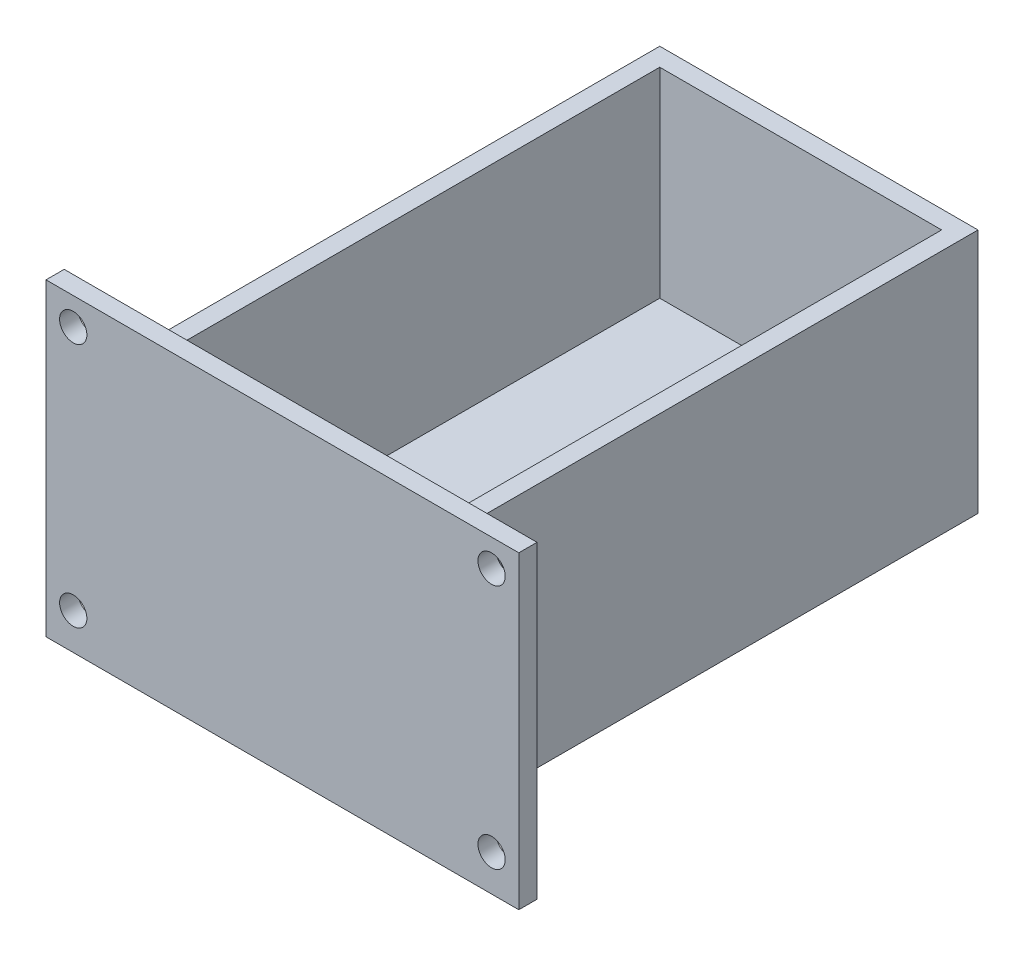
ISO-10303-21;
HEADER;
FILE_DESCRIPTION(('STEP AP214'),'2;1');
FILE_NAME('part.step','',(''),(''),'','','');
FILE_SCHEMA(('AUTOMOTIVE_DESIGN { 1 0 10303 214 1 1 1 1 }'));
ENDSEC;
DATA;
#1=APPLICATION_CONTEXT('core data for automotive mechanical design processes');
#2=APPLICATION_PROTOCOL_DEFINITION('international standard','automotive_design',2000,#1);
#3=PRODUCT_CONTEXT('',#1,'mechanical');
#4=PRODUCT('Part','Part','',(#3));
#5=PRODUCT_RELATED_PRODUCT_CATEGORY('part','',(#4));
#6=PRODUCT_DEFINITION_FORMATION('','',#4);
#7=PRODUCT_DEFINITION_CONTEXT('part definition',#1,'design');
#8=PRODUCT_DEFINITION('design','',#6,#7);
#9=PRODUCT_DEFINITION_SHAPE('','',#8);
#10=(LENGTH_UNIT() NAMED_UNIT(*) SI_UNIT(.MILLI.,.METRE.));
#11=(NAMED_UNIT(*) PLANE_ANGLE_UNIT() SI_UNIT($,.RADIAN.));
#12=(NAMED_UNIT(*) SI_UNIT($,.STERADIAN.) SOLID_ANGLE_UNIT());
#13=UNCERTAINTY_MEASURE_WITH_UNIT(LENGTH_MEASURE(1.E-05),#10,'distance_accuracy_value','');
#14=(GEOMETRIC_REPRESENTATION_CONTEXT(3) GLOBAL_UNCERTAINTY_ASSIGNED_CONTEXT((#13)) GLOBAL_UNIT_ASSIGNED_CONTEXT((#10,
#11,#12)) REPRESENTATION_CONTEXT('',''));
#15=CARTESIAN_POINT('',(0.,0.,0.));
#16=DIRECTION('',(0.,0.,1.));
#17=DIRECTION('',(1.,0.,0.));
#18=AXIS2_PLACEMENT_3D('',#15,#16,#17);
#19=CARTESIAN_POINT('',(17.5,15.,-57.));
#20=DIRECTION('',(1.,0.,0.));
#21=DIRECTION('',(0.,1.,0.));
#22=AXIS2_PLACEMENT_3D('',#19,#20,#21);
#23=PLANE('',#22);
#24=DIRECTION('',(0.,1.,0.));
#25=VECTOR('',#24,1.);
#26=CARTESIAN_POINT('',(17.5,15.,0.));
#27=LINE('',#26,#25);
#28=CARTESIAN_POINT('',(17.5,-12.,0.));
#29=VERTEX_POINT('',#28);
#30=CARTESIAN_POINT('',(17.5,15.,0.));
#31=VERTEX_POINT('',#30);
#32=EDGE_CURVE('E162',#29,#31,#27,.T.);
#33=ORIENTED_EDGE('',*,*,#32,.F.);
#34=DIRECTION('',(0.,0.,1.));
#35=VECTOR('',#34,1.);
#36=CARTESIAN_POINT('',(17.5,-12.,-57.));
#37=LINE('',#36,#35);
#38=CARTESIAN_POINT('',(17.5,-12.,-57.));
#39=VERTEX_POINT('',#38);
#40=EDGE_CURVE('E193',#39,#29,#37,.T.);
#41=ORIENTED_EDGE('',*,*,#40,.F.);
#42=DIRECTION('',(0.,1.,0.));
#43=VECTOR('',#42,1.);
#44=CARTESIAN_POINT('',(17.5,15.,-57.));
#45=LINE('',#44,#43);
#46=CARTESIAN_POINT('',(17.5,15.,-57.));
#47=VERTEX_POINT('',#46);
#48=EDGE_CURVE('E163',#39,#47,#45,.T.);
#49=ORIENTED_EDGE('',*,*,#48,.T.);
#50=DIRECTION('',(0.,0.,1.));
#51=VECTOR('',#50,1.);
#52=CARTESIAN_POINT('',(17.5,15.,-57.));
#53=LINE('',#52,#51);
#54=EDGE_CURVE('E40',#47,#31,#53,.T.);
#55=ORIENTED_EDGE('',*,*,#54,.T.);
#56=EDGE_LOOP('',(#33,#41,#49,#55));
#57=FACE_BOUND('',#56,.T.);
#58=ADVANCED_FACE('F37',(#57),#23,.T.);
#59=CARTESIAN_POINT('',(-17.5,15.,-57.));
#60=DIRECTION('',(-1.,0.,0.));
#61=DIRECTION('',(0.,-1.,0.));
#62=AXIS2_PLACEMENT_3D('',#59,#60,#61);
#63=PLANE('',#62);
#64=DIRECTION('',(0.,-1.,0.));
#65=VECTOR('',#64,1.);
#66=CARTESIAN_POINT('',(-17.5,15.,-57.));
#67=LINE('',#66,#65);
#68=CARTESIAN_POINT('',(-17.5,15.,-57.));
#69=VERTEX_POINT('',#68);
#70=CARTESIAN_POINT('',(-17.5,-12.,-57.));
#71=VERTEX_POINT('',#70);
#72=EDGE_CURVE('E169',#69,#71,#67,.T.);
#73=ORIENTED_EDGE('',*,*,#72,.T.);
#74=DIRECTION('',(0.,0.,-1.));
#75=VECTOR('',#74,1.);
#76=CARTESIAN_POINT('',(-17.5,-12.,0.));
#77=LINE('',#76,#75);
#78=CARTESIAN_POINT('',(-17.5,-12.,0.));
#79=VERTEX_POINT('',#78);
#80=EDGE_CURVE('E188',#79,#71,#77,.T.);
#81=ORIENTED_EDGE('',*,*,#80,.F.);
#82=DIRECTION('',(0.,-1.,0.));
#83=VECTOR('',#82,1.);
#84=CARTESIAN_POINT('',(-17.5,15.,0.));
#85=LINE('',#84,#83);
#86=CARTESIAN_POINT('',(-17.5,15.,0.));
#87=VERTEX_POINT('',#86);
#88=EDGE_CURVE('E166',#87,#79,#85,.T.);
#89=ORIENTED_EDGE('',*,*,#88,.F.);
#90=DIRECTION('',(0.,0.,1.));
#91=VECTOR('',#90,1.);
#92=CARTESIAN_POINT('',(-17.5,15.,-57.));
#93=LINE('',#92,#91);
#94=EDGE_CURVE('E11',#69,#87,#93,.T.);
#95=ORIENTED_EDGE('',*,*,#94,.F.);
#96=EDGE_LOOP('',(#73,#81,#89,#95));
#97=FACE_BOUND('',#96,.T.);
#98=ADVANCED_FACE('F186',(#97),#63,.T.);
#99=CARTESIAN_POINT('',(0.,0.,-57.));
#100=DIRECTION('',(0.,0.,1.));
#101=DIRECTION('',(1.,0.,0.));
#102=AXIS2_PLACEMENT_3D('',#99,#100,#101);
#103=PLANE('',#102);
#104=DIRECTION('',(1.,0.,0.));
#105=VECTOR('',#104,1.);
#106=CARTESIAN_POINT('',(-17.5,-12.,-57.));
#107=LINE('',#106,#105);
#108=EDGE_CURVE('E191',#71,#39,#107,.T.);
#109=ORIENTED_EDGE('',*,*,#108,.F.);
#110=ORIENTED_EDGE('',*,*,#72,.F.);
#111=DIRECTION('',(-1.,0.,0.));
#112=VECTOR('',#111,1.);
#113=CARTESIAN_POINT('',(-17.5,15.,-57.));
#114=LINE('',#113,#112);
#115=EDGE_CURVE('E165',#47,#69,#114,.T.);
#116=ORIENTED_EDGE('',*,*,#115,.F.);
#117=ORIENTED_EDGE('',*,*,#48,.F.);
#118=EDGE_LOOP('',(#109,#110,#116,#117));
#119=FACE_BOUND('',#118,.T.);
#120=ADVANCED_FACE('F284',(#119),#103,.F.);
#121=CARTESIAN_POINT('',(-17.5,15.,-57.));
#122=DIRECTION('',(0.,1.,0.));
#123=DIRECTION('',(0.,0.,1.));
#124=AXIS2_PLACEMENT_3D('',#121,#122,#123);
#125=PLANE('',#124);
#126=DIRECTION('',(-1.,0.,0.));
#127=VECTOR('',#126,1.);
#128=CARTESIAN_POINT('',(-17.5,15.,0.));
#129=LINE('',#128,#127);
#130=EDGE_CURVE('E173',#31,#87,#129,.T.);
#131=ORIENTED_EDGE('',*,*,#130,.F.);
#132=ORIENTED_EDGE('',*,*,#54,.F.);
#133=ORIENTED_EDGE('',*,*,#115,.T.);
#134=ORIENTED_EDGE('',*,*,#94,.T.);
#135=EDGE_LOOP('',(#131,#132,#133,#134));
#136=FACE_BOUND('',#135,.T.);
#137=DIRECTION('',(0.,0.,1.));
#138=VECTOR('',#137,1.);
#139=CARTESIAN_POINT('',(-15.5,15.,-55.));
#140=LINE('',#139,#138);
#141=CARTESIAN_POINT('',(-15.5,15.,-55.));
#142=VERTEX_POINT('',#141);
#143=CARTESIAN_POINT('',(-15.5,15.,-2.));
#144=VERTEX_POINT('',#143);
#145=EDGE_CURVE('E203',#142,#144,#140,.T.);
#146=ORIENTED_EDGE('',*,*,#145,.F.);
#147=DIRECTION('',(1.,0.,0.));
#148=VECTOR('',#147,1.);
#149=CARTESIAN_POINT('',(-15.5,15.,-55.));
#150=LINE('',#149,#148);
#151=CARTESIAN_POINT('',(15.5,15.,-55.));
#152=VERTEX_POINT('',#151);
#153=EDGE_CURVE('E59',#142,#152,#150,.T.);
#154=ORIENTED_EDGE('',*,*,#153,.T.);
#155=DIRECTION('',(0.,0.,1.));
#156=VECTOR('',#155,1.);
#157=CARTESIAN_POINT('',(15.5,15.,-55.));
#158=LINE('',#157,#156);
#159=CARTESIAN_POINT('',(15.5,15.,-2.));
#160=VERTEX_POINT('',#159);
#161=EDGE_CURVE('E213',#152,#160,#158,.T.);
#162=ORIENTED_EDGE('',*,*,#161,.T.);
#163=DIRECTION('',(1.,0.,0.));
#164=VECTOR('',#163,1.);
#165=CARTESIAN_POINT('',(-15.5,15.,-2.));
#166=LINE('',#165,#164);
#167=EDGE_CURVE('E216',#144,#160,#166,.T.);
#168=ORIENTED_EDGE('',*,*,#167,.F.);
#169=EDGE_LOOP('',(#146,#154,#162,#168));
#170=FACE_BOUND('',#169,.T.);
#171=ADVANCED_FACE('F276',(#136,#170),#125,.T.);
#172=CARTESIAN_POINT('',(0.,0.,0.));
#173=DIRECTION('',(0.,0.,1.));
#174=DIRECTION('',(1.,0.,0.));
#175=AXIS2_PLACEMENT_3D('',#172,#173,#174);
#176=PLANE('',#175);
#177=CARTESIAN_POINT('',(23.0044087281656,-12.,0.));
#178=DIRECTION('',(0.,0.,1.));
#179=DIRECTION('',(1.,0.,0.));
#180=AXIS2_PLACEMENT_3D('',#177,#178,#179);
#181=CIRCLE('',#180,1.5);
#182=CARTESIAN_POINT('',(24.5044087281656,-12.,0.));
#183=VERTEX_POINT('',#182);
#184=EDGE_CURVE('E130',#183,#183,#181,.T.);
#185=ORIENTED_EDGE('',*,*,#184,.T.);
#186=EDGE_LOOP('',(#185));
#187=FACE_BOUND('',#186,.T.);
#188=CARTESIAN_POINT('',(-23.0044087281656,-12.,0.));
#189=DIRECTION('',(0.,0.,1.));
#190=DIRECTION('',(1.,0.,0.));
#191=AXIS2_PLACEMENT_3D('',#188,#189,#190);
#192=CIRCLE('',#191,1.5);
#193=CARTESIAN_POINT('',(-21.5044087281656,-12.,0.));
#194=VERTEX_POINT('',#193);
#195=EDGE_CURVE('E237',#194,#194,#192,.T.);
#196=ORIENTED_EDGE('',*,*,#195,.T.);
#197=EDGE_LOOP('',(#196));
#198=FACE_BOUND('',#197,.T.);
#199=CARTESIAN_POINT('',(-23.0044087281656,15.,0.));
#200=DIRECTION('',(0.,0.,1.));
#201=DIRECTION('',(1.,0.,0.));
#202=AXIS2_PLACEMENT_3D('',#199,#200,#201);
#203=CIRCLE('',#202,1.5);
#204=CARTESIAN_POINT('',(-21.5044087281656,15.,0.));
#205=VERTEX_POINT('',#204);
#206=EDGE_CURVE('E240',#205,#205,#203,.T.);
#207=ORIENTED_EDGE('',*,*,#206,.T.);
#208=EDGE_LOOP('',(#207));
#209=FACE_BOUND('',#208,.T.);
#210=CARTESIAN_POINT('',(23.0044087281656,15.,0.));
#211=DIRECTION('',(0.,0.,1.));
#212=DIRECTION('',(1.,0.,0.));
#213=AXIS2_PLACEMENT_3D('',#210,#211,#212);
#214=CIRCLE('',#213,1.5);
#215=CARTESIAN_POINT('',(24.5044087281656,15.,0.));
#216=VERTEX_POINT('',#215);
#217=EDGE_CURVE('E243',#216,#216,#214,.T.);
#218=ORIENTED_EDGE('',*,*,#217,.T.);
#219=EDGE_LOOP('',(#218));
#220=FACE_BOUND('',#219,.T.);
#221=DIRECTION('',(-1.,0.,0.));
#222=VECTOR('',#221,1.);
#223=CARTESIAN_POINT('',(17.5,-12.,0.));
#224=LINE('',#223,#222);
#225=EDGE_CURVE('E181',#29,#79,#224,.T.);
#226=ORIENTED_EDGE('',*,*,#225,.F.);
#227=ORIENTED_EDGE('',*,*,#32,.T.);
#228=ORIENTED_EDGE('',*,*,#130,.T.);
#229=ORIENTED_EDGE('',*,*,#88,.T.);
#230=EDGE_LOOP('',(#226,#227,#228,#229));
#231=FACE_BOUND('',#230,.T.);
#232=DIRECTION('',(0.,1.,0.));
#233=VECTOR('',#232,1.);
#234=CARTESIAN_POINT('',(26.,18.,0.));
#235=LINE('',#234,#233);
#236=CARTESIAN_POINT('',(26.,-16.,0.));
#237=VERTEX_POINT('',#236);
#238=CARTESIAN_POINT('',(26.,18.,0.));
#239=VERTEX_POINT('',#238);
#240=EDGE_CURVE('E154',#237,#239,#235,.T.);
#241=ORIENTED_EDGE('',*,*,#240,.F.);
#242=DIRECTION('',(-1.,0.,0.));
#243=VECTOR('',#242,1.);
#244=CARTESIAN_POINT('',(0.,-16.,0.));
#245=LINE('',#244,#243);
#246=CARTESIAN_POINT('',(-26.,-16.,0.));
#247=VERTEX_POINT('',#246);
#248=EDGE_CURVE('E140',#237,#247,#245,.T.);
#249=ORIENTED_EDGE('',*,*,#248,.T.);
#250=DIRECTION('',(0.,-1.,0.));
#251=VECTOR('',#250,1.);
#252=CARTESIAN_POINT('',(-26.,18.,0.));
#253=LINE('',#252,#251);
#254=CARTESIAN_POINT('',(-26.,18.,0.));
#255=VERTEX_POINT('',#254);
#256=EDGE_CURVE('E139',#255,#247,#253,.T.);
#257=ORIENTED_EDGE('',*,*,#256,.F.);
#258=DIRECTION('',(-1.,0.,0.));
#259=VECTOR('',#258,1.);
#260=CARTESIAN_POINT('',(-26.,18.,0.));
#261=LINE('',#260,#259);
#262=EDGE_CURVE('E156',#239,#255,#261,.T.);
#263=ORIENTED_EDGE('',*,*,#262,.F.);
#264=EDGE_LOOP('',(#241,#249,#257,#263));
#265=FACE_BOUND('',#264,.T.);
#266=ADVANCED_FACE('F179',(#187,#198,#209,#220,#231,#265),#176,.F.);
#267=CARTESIAN_POINT('',(26.,18.,2.));
#268=DIRECTION('',(-1.,0.,0.));
#269=DIRECTION('',(0.,0.,1.));
#270=AXIS2_PLACEMENT_3D('',#267,#268,#269);
#271=PLANE('',#270);
#272=DIRECTION('',(0.,1.,0.));
#273=VECTOR('',#272,1.);
#274=CARTESIAN_POINT('',(26.,18.,2.));
#275=LINE('',#274,#273);
#276=CARTESIAN_POINT('',(26.,-16.,2.));
#277=VERTEX_POINT('',#276);
#278=CARTESIAN_POINT('',(26.,18.,2.));
#279=VERTEX_POINT('',#278);
#280=EDGE_CURVE('E150',#277,#279,#275,.T.);
#281=ORIENTED_EDGE('',*,*,#280,.F.);
#282=DIRECTION('',(0.,0.,1.));
#283=VECTOR('',#282,1.);
#284=CARTESIAN_POINT('',(26.,-16.,-57.));
#285=LINE('',#284,#283);
#286=EDGE_CURVE('E51',#237,#277,#285,.T.);
#287=ORIENTED_EDGE('',*,*,#286,.F.);
#288=ORIENTED_EDGE('',*,*,#240,.T.);
#289=DIRECTION('',(0.,0.,-1.));
#290=VECTOR('',#289,1.);
#291=CARTESIAN_POINT('',(26.,18.,2.));
#292=LINE('',#291,#290);
#293=EDGE_CURVE('E148',#279,#239,#292,.T.);
#294=ORIENTED_EDGE('',*,*,#293,.F.);
#295=EDGE_LOOP('',(#281,#287,#288,#294));
#296=FACE_BOUND('',#295,.T.);
#297=ADVANCED_FACE('F230',(#296),#271,.F.);
#298=CARTESIAN_POINT('',(-26.,18.,2.));
#299=DIRECTION('',(0.,-1.,0.));
#300=DIRECTION('',(0.,0.,-1.));
#301=AXIS2_PLACEMENT_3D('',#298,#299,#300);
#302=PLANE('',#301);
#303=ORIENTED_EDGE('',*,*,#262,.T.);
#304=DIRECTION('',(0.,0.,-1.));
#305=VECTOR('',#304,1.);
#306=CARTESIAN_POINT('',(-26.,18.,2.));
#307=LINE('',#306,#305);
#308=CARTESIAN_POINT('',(-26.,18.,2.));
#309=VERTEX_POINT('',#308);
#310=EDGE_CURVE('E146',#309,#255,#307,.T.);
#311=ORIENTED_EDGE('',*,*,#310,.F.);
#312=DIRECTION('',(-1.,0.,0.));
#313=VECTOR('',#312,1.);
#314=CARTESIAN_POINT('',(-26.,18.,2.));
#315=LINE('',#314,#313);
#316=EDGE_CURVE('E144',#279,#309,#315,.T.);
#317=ORIENTED_EDGE('',*,*,#316,.F.);
#318=ORIENTED_EDGE('',*,*,#293,.T.);
#319=EDGE_LOOP('',(#303,#311,#317,#318));
#320=FACE_BOUND('',#319,.T.);
#321=ADVANCED_FACE('F229',(#320),#302,.F.);
#322=CARTESIAN_POINT('',(-26.,18.,2.));
#323=DIRECTION('',(1.,0.,0.));
#324=DIRECTION('',(0.,0.,-1.));
#325=AXIS2_PLACEMENT_3D('',#322,#323,#324);
#326=PLANE('',#325);
#327=ORIENTED_EDGE('',*,*,#256,.T.);
#328=DIRECTION('',(0.,0.,1.));
#329=VECTOR('',#328,1.);
#330=CARTESIAN_POINT('',(-26.,-16.,-57.));
#331=LINE('',#330,#329);
#332=CARTESIAN_POINT('',(-26.,-16.,2.));
#333=VERTEX_POINT('',#332);
#334=EDGE_CURVE('E125',#247,#333,#331,.T.);
#335=ORIENTED_EDGE('',*,*,#334,.T.);
#336=DIRECTION('',(0.,-1.,0.));
#337=VECTOR('',#336,1.);
#338=CARTESIAN_POINT('',(-26.,18.,2.));
#339=LINE('',#338,#337);
#340=EDGE_CURVE('E137',#309,#333,#339,.T.);
#341=ORIENTED_EDGE('',*,*,#340,.F.);
#342=ORIENTED_EDGE('',*,*,#310,.T.);
#343=EDGE_LOOP('',(#327,#335,#341,#342));
#344=FACE_BOUND('',#343,.T.);
#345=ADVANCED_FACE('F135',(#344),#326,.F.);
#346=CARTESIAN_POINT('',(0.,0.,2.));
#347=DIRECTION('',(0.,0.,1.));
#348=DIRECTION('',(1.,0.,0.));
#349=AXIS2_PLACEMENT_3D('',#346,#347,#348);
#350=PLANE('',#349);
#351=CARTESIAN_POINT('',(23.0044087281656,-12.,2.));
#352=DIRECTION('',(0.,0.,1.));
#353=DIRECTION('',(1.,0.,0.));
#354=AXIS2_PLACEMENT_3D('',#351,#352,#353);
#355=CIRCLE('',#354,1.5);
#356=CARTESIAN_POINT('',(24.5044087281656,-12.,2.));
#357=VERTEX_POINT('',#356);
#358=EDGE_CURVE('E250',#357,#357,#355,.T.);
#359=ORIENTED_EDGE('',*,*,#358,.F.);
#360=EDGE_LOOP('',(#359));
#361=FACE_BOUND('',#360,.T.);
#362=CARTESIAN_POINT('',(-23.0044087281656,-12.,2.));
#363=DIRECTION('',(0.,0.,1.));
#364=DIRECTION('',(-1.,0.,0.));
#365=AXIS2_PLACEMENT_3D('',#362,#363,#364);
#366=CIRCLE('',#365,1.5);
#367=CARTESIAN_POINT('',(-24.5044087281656,-12.,2.));
#368=VERTEX_POINT('',#367);
#369=EDGE_CURVE('E253',#368,#368,#366,.T.);
#370=ORIENTED_EDGE('',*,*,#369,.F.);
#371=EDGE_LOOP('',(#370));
#372=FACE_BOUND('',#371,.T.);
#373=CARTESIAN_POINT('',(-23.0044087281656,15.,2.));
#374=DIRECTION('',(0.,0.,1.));
#375=DIRECTION('',(1.,0.,0.));
#376=AXIS2_PLACEMENT_3D('',#373,#374,#375);
#377=CIRCLE('',#376,1.5);
#378=CARTESIAN_POINT('',(-21.5044087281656,15.,2.));
#379=VERTEX_POINT('',#378);
#380=EDGE_CURVE('E249',#379,#379,#377,.T.);
#381=ORIENTED_EDGE('',*,*,#380,.F.);
#382=EDGE_LOOP('',(#381));
#383=FACE_BOUND('',#382,.T.);
#384=CARTESIAN_POINT('',(23.0044087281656,15.,2.));
#385=DIRECTION('',(0.,0.,1.));
#386=DIRECTION('',(-1.,0.,0.));
#387=AXIS2_PLACEMENT_3D('',#384,#385,#386);
#388=CIRCLE('',#387,1.5);
#389=CARTESIAN_POINT('',(21.5044087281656,15.,2.));
#390=VERTEX_POINT('',#389);
#391=EDGE_CURVE('E246',#390,#390,#388,.T.);
#392=ORIENTED_EDGE('',*,*,#391,.F.);
#393=EDGE_LOOP('',(#392));
#394=FACE_BOUND('',#393,.T.);
#395=DIRECTION('',(-1.,0.,0.));
#396=VECTOR('',#395,1.);
#397=CARTESIAN_POINT('',(-26.,-16.,2.));
#398=LINE('',#397,#396);
#399=EDGE_CURVE('E122',#277,#333,#398,.T.);
#400=ORIENTED_EDGE('',*,*,#399,.F.);
#401=ORIENTED_EDGE('',*,*,#280,.T.);
#402=ORIENTED_EDGE('',*,*,#316,.T.);
#403=ORIENTED_EDGE('',*,*,#340,.T.);
#404=EDGE_LOOP('',(#400,#401,#402,#403));
#405=FACE_BOUND('',#404,.T.);
#406=ADVANCED_FACE('F142',(#361,#372,#383,#394,#405),#350,.T.);
#407=CARTESIAN_POINT('',(-15.5,-7.,-55.));
#408=DIRECTION('',(0.,0.,1.));
#409=DIRECTION('',(1.,0.,0.));
#410=AXIS2_PLACEMENT_3D('',#407,#408,#409);
#411=PLANE('',#410);
#412=ORIENTED_EDGE('',*,*,#153,.F.);
#413=DIRECTION('',(0.,1.,0.));
#414=VECTOR('',#413,1.);
#415=CARTESIAN_POINT('',(-15.5,-7.,-55.));
#416=LINE('',#415,#414);
#417=CARTESIAN_POINT('',(-15.5,-7.,-55.));
#418=VERTEX_POINT('',#417);
#419=EDGE_CURVE('E211',#418,#142,#416,.T.);
#420=ORIENTED_EDGE('',*,*,#419,.F.);
#421=DIRECTION('',(1.,0.,0.));
#422=VECTOR('',#421,1.);
#423=CARTESIAN_POINT('',(-15.5,-7.,-55.));
#424=LINE('',#423,#422);
#425=CARTESIAN_POINT('',(15.5,-7.,-55.));
#426=VERTEX_POINT('',#425);
#427=EDGE_CURVE('E199',#418,#426,#424,.T.);
#428=ORIENTED_EDGE('',*,*,#427,.T.);
#429=DIRECTION('',(0.,1.,0.));
#430=VECTOR('',#429,1.);
#431=CARTESIAN_POINT('',(15.5,-7.,-55.));
#432=LINE('',#431,#430);
#433=EDGE_CURVE('E157',#426,#152,#432,.T.);
#434=ORIENTED_EDGE('',*,*,#433,.T.);
#435=EDGE_LOOP('',(#412,#420,#428,#434));
#436=FACE_BOUND('',#435,.T.);
#437=ADVANCED_FACE('F264',(#436),#411,.T.);
#438=CARTESIAN_POINT('',(15.5,-7.,-55.));
#439=DIRECTION('',(-1.,0.,0.));
#440=DIRECTION('',(0.,0.,1.));
#441=AXIS2_PLACEMENT_3D('',#438,#439,#440);
#442=PLANE('',#441);
#443=ORIENTED_EDGE('',*,*,#161,.F.);
#444=ORIENTED_EDGE('',*,*,#433,.F.);
#445=DIRECTION('',(0.,0.,1.));
#446=VECTOR('',#445,1.);
#447=CARTESIAN_POINT('',(15.5,-7.,-55.));
#448=LINE('',#447,#446);
#449=CARTESIAN_POINT('',(15.5,-7.,-2.));
#450=VERTEX_POINT('',#449);
#451=EDGE_CURVE('E202',#426,#450,#448,.T.);
#452=ORIENTED_EDGE('',*,*,#451,.T.);
#453=DIRECTION('',(0.,1.,0.));
#454=VECTOR('',#453,1.);
#455=CARTESIAN_POINT('',(15.5,-7.,-2.));
#456=LINE('',#455,#454);
#457=EDGE_CURVE('E224',#450,#160,#456,.T.);
#458=ORIENTED_EDGE('',*,*,#457,.T.);
#459=EDGE_LOOP('',(#443,#444,#452,#458));
#460=FACE_BOUND('',#459,.T.);
#461=ADVANCED_FACE('F321',(#460),#442,.T.);
#462=CARTESIAN_POINT('',(-15.5,-7.,-2.));
#463=DIRECTION('',(0.,0.,1.));
#464=DIRECTION('',(1.,0.,0.));
#465=AXIS2_PLACEMENT_3D('',#462,#463,#464);
#466=PLANE('',#465);
#467=ORIENTED_EDGE('',*,*,#167,.T.);
#468=ORIENTED_EDGE('',*,*,#457,.F.);
#469=DIRECTION('',(1.,0.,0.));
#470=VECTOR('',#469,1.);
#471=CARTESIAN_POINT('',(-15.5,-7.,-2.));
#472=LINE('',#471,#470);
#473=CARTESIAN_POINT('',(-15.5,-7.,-2.));
#474=VERTEX_POINT('',#473);
#475=EDGE_CURVE('E205',#474,#450,#472,.T.);
#476=ORIENTED_EDGE('',*,*,#475,.F.);
#477=DIRECTION('',(0.,1.,0.));
#478=VECTOR('',#477,1.);
#479=CARTESIAN_POINT('',(-15.5,-7.,-2.));
#480=LINE('',#479,#478);
#481=EDGE_CURVE('E222',#474,#144,#480,.T.);
#482=ORIENTED_EDGE('',*,*,#481,.T.);
#483=EDGE_LOOP('',(#467,#468,#476,#482));
#484=FACE_BOUND('',#483,.T.);
#485=ADVANCED_FACE('F317',(#484),#466,.F.);
#486=CARTESIAN_POINT('',(-15.5,-7.,-55.));
#487=DIRECTION('',(-1.,0.,0.));
#488=DIRECTION('',(0.,0.,1.));
#489=AXIS2_PLACEMENT_3D('',#486,#487,#488);
#490=PLANE('',#489);
#491=ORIENTED_EDGE('',*,*,#145,.T.);
#492=ORIENTED_EDGE('',*,*,#481,.F.);
#493=DIRECTION('',(0.,0.,1.));
#494=VECTOR('',#493,1.);
#495=CARTESIAN_POINT('',(-15.5,-7.,-55.));
#496=LINE('',#495,#494);
#497=EDGE_CURVE('E208',#418,#474,#496,.T.);
#498=ORIENTED_EDGE('',*,*,#497,.F.);
#499=ORIENTED_EDGE('',*,*,#419,.T.);
#500=EDGE_LOOP('',(#491,#492,#498,#499));
#501=FACE_BOUND('',#500,.T.);
#502=ADVANCED_FACE('F311',(#501),#490,.F.);
#503=CARTESIAN_POINT('',(0.,-7.,0.));
#504=DIRECTION('',(0.,-1.,0.));
#505=DIRECTION('',(0.,0.,-1.));
#506=AXIS2_PLACEMENT_3D('',#503,#504,#505);
#507=PLANE('',#506);
#508=ORIENTED_EDGE('',*,*,#427,.F.);
#509=ORIENTED_EDGE('',*,*,#497,.T.);
#510=ORIENTED_EDGE('',*,*,#475,.T.);
#511=ORIENTED_EDGE('',*,*,#451,.F.);
#512=EDGE_LOOP('',(#508,#509,#510,#511));
#513=FACE_BOUND('',#512,.T.);
#514=ADVANCED_FACE('F304',(#513),#507,.F.);
#515=CARTESIAN_POINT('',(0.,-12.,0.));
#516=DIRECTION('',(0.,-1.,0.));
#517=DIRECTION('',(0.,0.,-1.));
#518=AXIS2_PLACEMENT_3D('',#515,#516,#517);
#519=PLANE('',#518);
#520=ORIENTED_EDGE('',*,*,#225,.T.);
#521=ORIENTED_EDGE('',*,*,#80,.T.);
#522=ORIENTED_EDGE('',*,*,#108,.T.);
#523=ORIENTED_EDGE('',*,*,#40,.T.);
#524=EDGE_LOOP('',(#520,#521,#522,#523));
#525=FACE_BOUND('',#524,.T.);
#526=ADVANCED_FACE('F302',(#525),#519,.T.);
#527=CARTESIAN_POINT('',(-26.,-16.,-57.));
#528=DIRECTION('',(0.,1.,0.));
#529=DIRECTION('',(0.,0.,1.));
#530=AXIS2_PLACEMENT_3D('',#527,#528,#529);
#531=PLANE('',#530);
#532=ORIENTED_EDGE('',*,*,#286,.T.);
#533=ORIENTED_EDGE('',*,*,#399,.T.);
#534=ORIENTED_EDGE('',*,*,#334,.F.);
#535=ORIENTED_EDGE('',*,*,#248,.F.);
#536=EDGE_LOOP('',(#532,#533,#534,#535));
#537=FACE_BOUND('',#536,.T.);
#538=ADVANCED_FACE('F124',(#537),#531,.F.);
#539=CARTESIAN_POINT('',(23.0044087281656,15.,-25.));
#540=DIRECTION('',(0.,0.,1.));
#541=DIRECTION('',(1.,0.,0.));
#542=AXIS2_PLACEMENT_3D('',#539,#540,#541);
#543=CYLINDRICAL_SURFACE('',#542,1.5);
#544=ORIENTED_EDGE('',*,*,#391,.T.);
#545=EDGE_LOOP('',(#544));
#546=FACE_BOUND('',#545,.T.);
#547=ORIENTED_EDGE('',*,*,#217,.F.);
#548=EDGE_LOOP('',(#547));
#549=FACE_BOUND('',#548,.T.);
#550=ADVANCED_FACE('F269',(#546,#549),#543,.F.);
#551=CARTESIAN_POINT('',(-23.0044087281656,15.,-25.));
#552=DIRECTION('',(0.,0.,1.));
#553=DIRECTION('',(1.,0.,0.));
#554=AXIS2_PLACEMENT_3D('',#551,#552,#553);
#555=CYLINDRICAL_SURFACE('',#554,1.5);
#556=ORIENTED_EDGE('',*,*,#380,.T.);
#557=EDGE_LOOP('',(#556));
#558=FACE_BOUND('',#557,.T.);
#559=ORIENTED_EDGE('',*,*,#206,.F.);
#560=EDGE_LOOP('',(#559));
#561=FACE_BOUND('',#560,.T.);
#562=ADVANCED_FACE('F259',(#558,#561),#555,.F.);
#563=CARTESIAN_POINT('',(-23.0044087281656,-12.,-25.));
#564=DIRECTION('',(0.,0.,1.));
#565=DIRECTION('',(1.,0.,0.));
#566=AXIS2_PLACEMENT_3D('',#563,#564,#565);
#567=CYLINDRICAL_SURFACE('',#566,1.5);
#568=ORIENTED_EDGE('',*,*,#369,.T.);
#569=EDGE_LOOP('',(#568));
#570=FACE_BOUND('',#569,.T.);
#571=ORIENTED_EDGE('',*,*,#195,.F.);
#572=EDGE_LOOP('',(#571));
#573=FACE_BOUND('',#572,.T.);
#574=ADVANCED_FACE('F423',(#570,#573),#567,.F.);
#575=CARTESIAN_POINT('',(23.0044087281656,-12.,-25.));
#576=DIRECTION('',(0.,0.,1.));
#577=DIRECTION('',(1.,0.,0.));
#578=AXIS2_PLACEMENT_3D('',#575,#576,#577);
#579=CYLINDRICAL_SURFACE('',#578,1.5);
#580=ORIENTED_EDGE('',*,*,#358,.T.);
#581=EDGE_LOOP('',(#580));
#582=FACE_BOUND('',#581,.T.);
#583=ORIENTED_EDGE('',*,*,#184,.F.);
#584=EDGE_LOOP('',(#583));
#585=FACE_BOUND('',#584,.T.);
#586=ADVANCED_FACE('F433',(#582,#585),#579,.F.);
#587=CLOSED_SHELL('',(#58,#98,#120,#171,#266,#297,#321,#345,#406,#437,#461,#485,#502,#514,#526,
#538,#550,#562,#574,#586));
#588=MANIFOLD_SOLID_BREP('B2',#587);
#589=ADVANCED_BREP_SHAPE_REPRESENTATION('',(#18,#588),#14);
#590=SHAPE_DEFINITION_REPRESENTATION(#9,#589);
ENDSEC;
END-ISO-10303-21;
